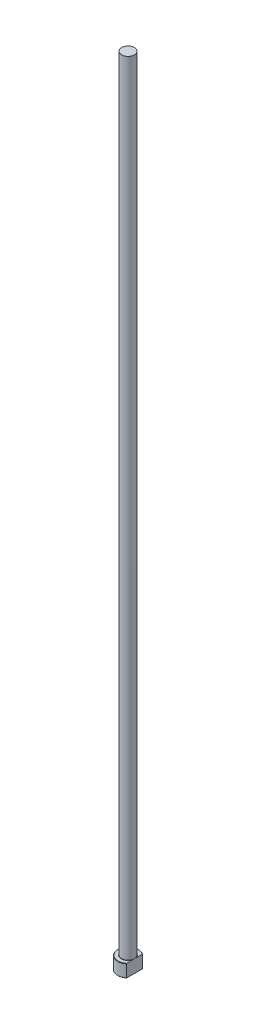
ISO-10303-21;
HEADER;
FILE_DESCRIPTION(('STEP AP214'),'2;1');
FILE_NAME('part.step','',(''),(''),'','','');
FILE_SCHEMA(('AUTOMOTIVE_DESIGN { 1 0 10303 214 1 1 1 1 }'));
ENDSEC;
DATA;
#1=APPLICATION_CONTEXT('core data for automotive mechanical design processes');
#2=APPLICATION_PROTOCOL_DEFINITION('international standard','automotive_design',2000,#1);
#3=PRODUCT_CONTEXT('',#1,'mechanical');
#4=PRODUCT('Part','Part','',(#3));
#5=PRODUCT_RELATED_PRODUCT_CATEGORY('part','',(#4));
#6=PRODUCT_DEFINITION_FORMATION('','',#4);
#7=PRODUCT_DEFINITION_CONTEXT('part definition',#1,'design');
#8=PRODUCT_DEFINITION('design','',#6,#7);
#9=PRODUCT_DEFINITION_SHAPE('','',#8);
#10=(LENGTH_UNIT() NAMED_UNIT(*) SI_UNIT(.MILLI.,.METRE.));
#11=(NAMED_UNIT(*) PLANE_ANGLE_UNIT() SI_UNIT($,.RADIAN.));
#12=(NAMED_UNIT(*) SI_UNIT($,.STERADIAN.) SOLID_ANGLE_UNIT());
#13=UNCERTAINTY_MEASURE_WITH_UNIT(LENGTH_MEASURE(1.E-05),#10,'distance_accuracy_value','');
#14=(GEOMETRIC_REPRESENTATION_CONTEXT(3) GLOBAL_UNCERTAINTY_ASSIGNED_CONTEXT((#13)) GLOBAL_UNIT_ASSIGNED_CONTEXT((#10,
#11,#12)) REPRESENTATION_CONTEXT('',''));
#15=CARTESIAN_POINT('',(0.,0.,0.));
#16=DIRECTION('',(0.,0.,1.));
#17=DIRECTION('',(1.,0.,0.));
#18=AXIS2_PLACEMENT_3D('',#15,#16,#17);
#19=CARTESIAN_POINT('',(0.,0.,0.));
#20=DIRECTION('',(0.,-1.,0.));
#21=DIRECTION('',(0.,0.,-1.));
#22=AXIS2_PLACEMENT_3D('',#19,#20,#21);
#23=PLANE('',#22);
#24=CARTESIAN_POINT('',(0.,0.,0.));
#25=DIRECTION('',(0.,-1.,0.));
#26=DIRECTION('',(0.,0.,-1.));
#27=AXIS2_PLACEMENT_3D('',#24,#25,#26);
#28=CIRCLE('',#27,6.29999999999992);
#29=CARTESIAN_POINT('',(3.99999999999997,0.,4.8672374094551));
#30=VERTEX_POINT('',#29);
#31=CARTESIAN_POINT('',(3.99999999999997,0.,-4.8672374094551));
#32=VERTEX_POINT('',#31);
#33=EDGE_CURVE('E98',#30,#32,#28,.T.);
#34=ORIENTED_EDGE('',*,*,#33,.T.);
#35=DIRECTION('',(0.,0.,1.));
#36=VECTOR('',#35,1.);
#37=CARTESIAN_POINT('',(3.99999999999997,0.,5.12347538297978));
#38=LINE('',#37,#36);
#39=EDGE_CURVE('E83',#32,#30,#38,.T.);
#40=ORIENTED_EDGE('',*,*,#39,.T.);
#41=EDGE_LOOP('',(#34,#40));
#42=FACE_BOUND('',#41,.T.);
#43=ADVANCED_FACE('F32',(#42),#23,.T.);
#44=CARTESIAN_POINT('',(0.,259.958771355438,0.));
#45=DIRECTION('',(0.,1.,0.));
#46=DIRECTION('',(0.,0.,1.));
#47=AXIS2_PLACEMENT_3D('',#44,#45,#46);
#48=CYLINDRICAL_SURFACE('',#47,6.49999999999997);
#49=CARTESIAN_POINT('',(0.,7.80000000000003,0.));
#50=DIRECTION('',(0.,1.,0.));
#51=DIRECTION('',(0.,0.,1.));
#52=AXIS2_PLACEMENT_3D('',#49,#50,#51);
#53=CIRCLE('',#52,6.49999999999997);
#54=CARTESIAN_POINT('',(3.99999999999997,7.80000000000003,5.12347538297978));
#55=VERTEX_POINT('',#54);
#56=CARTESIAN_POINT('',(3.99999999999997,7.80000000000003,-5.12347538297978));
#57=VERTEX_POINT('',#56);
#58=EDGE_CURVE('E104',#55,#57,#53,.F.);
#59=ORIENTED_EDGE('',*,*,#58,.T.);
#60=DIRECTION('',(0.,-1.,0.));
#61=VECTOR('',#60,1.);
#62=CARTESIAN_POINT('',(3.99999999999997,500.,-5.12347538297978));
#63=LINE('',#62,#61);
#64=CARTESIAN_POINT('',(3.99999999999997,0.200000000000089,-5.12347538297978));
#65=VERTEX_POINT('',#64);
#66=EDGE_CURVE('E183',#57,#65,#63,.T.);
#67=ORIENTED_EDGE('',*,*,#66,.T.);
#68=CARTESIAN_POINT('',(0.,0.200000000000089,0.));
#69=DIRECTION('',(0.,-1.,0.));
#70=DIRECTION('',(0.,0.,-1.));
#71=AXIS2_PLACEMENT_3D('',#68,#69,#70);
#72=CIRCLE('',#71,6.49999999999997);
#73=CARTESIAN_POINT('',(3.99999999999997,0.200000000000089,5.12347538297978));
#74=VERTEX_POINT('',#73);
#75=EDGE_CURVE('E100',#65,#74,#72,.F.);
#76=ORIENTED_EDGE('',*,*,#75,.T.);
#77=DIRECTION('',(0.,-1.,0.));
#78=VECTOR('',#77,1.);
#79=CARTESIAN_POINT('',(3.99999999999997,500.,5.12347538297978));
#80=LINE('',#79,#78);
#81=EDGE_CURVE('E93',#55,#74,#80,.T.);
#82=ORIENTED_EDGE('',*,*,#81,.F.);
#83=EDGE_LOOP('',(#59,#67,#76,#82));
#84=FACE_BOUND('',#83,.T.);
#85=ADVANCED_FACE('F158',(#84),#48,.T.);
#86=CARTESIAN_POINT('',(-6.49999999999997,8.,0.));
#87=DIRECTION('',(0.,1.,0.));
#88=DIRECTION('',(0.,0.,1.));
#89=AXIS2_PLACEMENT_3D('',#86,#87,#88);
#90=PLANE('',#89);
#91=CARTESIAN_POINT('',(0.,8.,0.));
#92=DIRECTION('',(0.,1.,0.));
#93=DIRECTION('',(0.,0.,1.));
#94=AXIS2_PLACEMENT_3D('',#91,#92,#93);
#95=CIRCLE('',#94,6.30000000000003);
#96=CARTESIAN_POINT('',(3.99999999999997,8.,-4.86723740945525));
#97=VERTEX_POINT('',#96);
#98=CARTESIAN_POINT('',(3.99999999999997,8.,4.86723740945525));
#99=VERTEX_POINT('',#98);
#100=EDGE_CURVE('E178',#97,#99,#95,.T.);
#101=ORIENTED_EDGE('',*,*,#100,.T.);
#102=DIRECTION('',(0.,0.,-1.));
#103=VECTOR('',#102,1.);
#104=CARTESIAN_POINT('',(3.99999999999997,8.,0.));
#105=LINE('',#104,#103);
#106=CARTESIAN_POINT('',(3.99999999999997,7.99999999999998,1.28062484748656));
#107=VERTEX_POINT('',#106);
#108=EDGE_CURVE('E57',#99,#107,#105,.T.);
#109=ORIENTED_EDGE('',*,*,#108,.T.);
#110=CARTESIAN_POINT('',(0.,8.,0.));
#111=DIRECTION('',(0.,1.,0.));
#112=DIRECTION('',(0.,0.,1.));
#113=AXIS2_PLACEMENT_3D('',#110,#111,#112);
#114=CIRCLE('',#113,4.19999999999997);
#115=CARTESIAN_POINT('',(3.99999999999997,7.99999999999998,-1.28062484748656));
#116=VERTEX_POINT('',#115);
#117=EDGE_CURVE('E107',#107,#116,#114,.F.);
#118=ORIENTED_EDGE('',*,*,#117,.T.);
#119=EDGE_CURVE('E136',#116,#97,#105,.T.);
#120=ORIENTED_EDGE('',*,*,#119,.T.);
#121=EDGE_LOOP('',(#101,#109,#118,#120));
#122=FACE_BOUND('',#121,.T.);
#123=ADVANCED_FACE('F147',(#122),#90,.T.);
#124=CARTESIAN_POINT('',(0.,8.00000000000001,0.));
#125=DIRECTION('',(0.,-1.,0.));
#126=DIRECTION('',(0.,0.,-1.));
#127=AXIS2_PLACEMENT_3D('',#124,#125,#126);
#128=CONICAL_SURFACE('',#127,6.30000000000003,0.785398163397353);
#129=ORIENTED_EDGE('',*,*,#58,.F.);
#130=CARTESIAN_POINT('',(3.99999999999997,2.33835680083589,11.2730168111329));
#131=CARTESIAN_POINT('',(3.99999999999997,2.50751109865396,11.0935258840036));
#132=CARTESIAN_POINT('',(3.99999999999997,2.6764300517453,10.9138129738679));
#133=CARTESIAN_POINT('',(3.99999999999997,3.0137169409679,10.5538688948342));
#134=CARTESIAN_POINT('',(3.99999999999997,3.18208487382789,10.3736377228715));
#135=CARTESIAN_POINT('',(3.99999999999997,3.68651578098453,9.8317608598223));
#136=CARTESIAN_POINT('',(3.99999999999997,4.02162663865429,9.46922758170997));
#137=CARTESIAN_POINT('',(3.99999999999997,4.69839264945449,8.73004878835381));
#138=CARTESIAN_POINT('',(3.99999999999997,5.03994227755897,8.35330632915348));
#139=CARTESIAN_POINT('',(3.99999999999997,5.54813444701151,7.78474717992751));
#140=CARTESIAN_POINT('',(3.99999999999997,5.71678224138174,7.59472329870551));
#141=CARTESIAN_POINT('',(3.99999999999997,6.05243048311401,7.21322727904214));
#142=CARTESIAN_POINT('',(3.99999999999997,6.21943094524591,7.02175515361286));
#143=CARTESIAN_POINT('',(3.99999999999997,6.55125779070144,6.63720143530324));
#144=CARTESIAN_POINT('',(3.99999999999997,6.71608581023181,6.44412125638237));
#145=CARTESIAN_POINT('',(3.99999999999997,7.04317390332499,6.05578163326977));
#146=CARTESIAN_POINT('',(3.99999999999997,7.20543388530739,5.86052211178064));
#147=CARTESIAN_POINT('',(3.99999999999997,7.52702721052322,5.4668180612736));
#148=CARTESIAN_POINT('',(3.99999999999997,7.68635259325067,5.26836701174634));
#149=CARTESIAN_POINT('',(3.99999999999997,8.00060742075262,4.86803282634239));
#150=CARTESIAN_POINT('',(3.99999999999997,8.15553731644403,4.66615004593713));
#151=CARTESIAN_POINT('',(3.99999999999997,8.45751575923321,4.26060182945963));
#152=CARTESIAN_POINT('',(3.99999999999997,8.60464039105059,4.05699334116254));
#153=CARTESIAN_POINT('',(3.99999999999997,8.8909995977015,3.64409822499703));
#154=CARTESIAN_POINT('',(3.99999999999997,9.0302302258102,3.43480883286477));
#155=CARTESIAN_POINT('',(3.99999999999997,9.29677357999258,3.00991388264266));
#156=CARTESIAN_POINT('',(3.99999999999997,9.42413322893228,2.7943380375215));
#157=CARTESIAN_POINT('',(3.99999999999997,9.66227069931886,2.35430355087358));
#158=CARTESIAN_POINT('',(3.99999999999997,9.77306978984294,2.12985677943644));
#159=CARTESIAN_POINT('',(3.99999999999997,9.9232417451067,1.77981866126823));
#160=CARTESIAN_POINT('',(3.99999999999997,9.97150219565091,1.65804958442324));
#161=CARTESIAN_POINT('',(3.99999999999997,10.0598239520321,1.41150602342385));
#162=CARTESIAN_POINT('',(3.99999999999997,10.0998835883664,1.2867309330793));
#163=CARTESIAN_POINT('',(3.99999999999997,10.1699893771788,1.03512545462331));
#164=CARTESIAN_POINT('',(3.99999999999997,10.2000910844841,0.908310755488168));
#165=CARTESIAN_POINT('',(3.99999999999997,10.2490705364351,0.652511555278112));
#166=CARTESIAN_POINT('',(3.99999999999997,10.2679495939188,0.523527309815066));
#167=CARTESIAN_POINT('',(3.99999999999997,10.2934980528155,0.262809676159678));
#168=CARTESIAN_POINT('',(3.99999999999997,10.3000223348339,0.131061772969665));
#169=CARTESIAN_POINT('',(3.99999999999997,10.2999775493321,-0.132423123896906));
#170=CARTESIAN_POINT('',(3.99999999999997,10.2934092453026,-0.264160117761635));
#171=CARTESIAN_POINT('',(3.99999999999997,10.2675780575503,-0.526867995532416));
#172=CARTESIAN_POINT('',(3.99999999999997,10.2482669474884,-0.65783405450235));
#173=CARTESIAN_POINT('',(3.99999999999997,10.1980980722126,-0.917527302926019));
#174=CARTESIAN_POINT('',(3.99999999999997,10.1672371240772,-1.04625386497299));
#175=CARTESIAN_POINT('',(3.99999999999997,10.0805844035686,-1.35405733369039));
#176=CARTESIAN_POINT('',(3.99999999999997,10.0197633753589,-1.53171039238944));
#177=CARTESIAN_POINT('',(3.99999999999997,9.88274788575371,-1.88095872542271));
#178=CARTESIAN_POINT('',(3.99999999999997,9.80654370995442,-2.05255009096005));
#179=CARTESIAN_POINT('',(3.99999999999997,9.68319777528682,-2.30659899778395));
#180=CARTESIAN_POINT('',(3.99999999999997,9.64031955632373,-2.39117275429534));
#181=CARTESIAN_POINT('',(3.99999999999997,9.55202002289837,-2.55898629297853));
#182=CARTESIAN_POINT('',(3.99999999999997,9.50659867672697,-2.64222605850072));
#183=CARTESIAN_POINT('',(3.99999999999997,9.4135865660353,-2.80743574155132));
#184=CARTESIAN_POINT('',(3.99999999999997,9.3659966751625,-2.88940615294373));
#185=CARTESIAN_POINT('',(3.99999999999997,9.26892422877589,-3.05220990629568));
#186=CARTESIAN_POINT('',(3.99999999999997,9.21944176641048,-3.13304330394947));
#187=CARTESIAN_POINT('',(3.99999999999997,9.04529267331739,-3.41112924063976));
#188=CARTESIAN_POINT('',(3.99999999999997,8.91648308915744,-3.60579191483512));
#189=CARTESIAN_POINT('',(3.99999999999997,8.65175618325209,-3.99024288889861));
#190=CARTESIAN_POINT('',(3.99999999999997,8.51583685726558,-4.18002979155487));
#191=CARTESIAN_POINT('',(3.99999999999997,8.23863283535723,-4.55590680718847));
#192=CARTESIAN_POINT('',(3.99999999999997,8.09734319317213,-4.74199325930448));
#193=CARTESIAN_POINT('',(3.99999999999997,7.81082146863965,-5.11106130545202));
#194=CARTESIAN_POINT('',(3.99999999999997,7.66558980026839,-5.29404322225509));
#195=CARTESIAN_POINT('',(3.99999999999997,7.37148704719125,-5.65825720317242));
#196=CARTESIAN_POINT('',(3.99999999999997,7.22260377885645,-5.8394794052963));
#197=CARTESIAN_POINT('',(3.99999999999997,6.92240731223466,-6.19990198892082));
#198=CARTESIAN_POINT('',(3.99999999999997,6.77109406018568,-6.37910232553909));
#199=CARTESIAN_POINT('',(3.99999999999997,6.314431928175,-6.91404380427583));
#200=CARTESIAN_POINT('',(3.99999999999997,6.00619978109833,-7.26732233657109));
#201=CARTESIAN_POINT('',(3.99999999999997,5.4201977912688,-7.92915827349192));
#202=CARTESIAN_POINT('',(3.99999999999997,5.14297898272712,-8.23820650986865));
#203=CARTESIAN_POINT('',(3.99999999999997,4.58554936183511,-8.85367584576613));
#204=CARTESIAN_POINT('',(3.99999999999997,4.30533810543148,-9.16009654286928));
#205=CARTESIAN_POINT('',(3.99999999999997,3.74491435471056,-9.76850943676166));
#206=CARTESIAN_POINT('',(3.99999999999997,3.46471907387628,-10.0705175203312));
#207=CARTESIAN_POINT('',(3.99999999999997,2.90267484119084,-10.6728856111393));
#208=CARTESIAN_POINT('',(3.99999999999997,2.62082621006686,-10.9732459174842));
#209=CARTESIAN_POINT('',(3.99999999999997,2.3383568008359,-11.2730168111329));
#210=B_SPLINE_CURVE_WITH_KNOTS('',3,(#130,#131,#132,#133,#134,#135,#136,#137,#138,#139,#140,
#141,#142,#143,#144,#145,#146,#147,#148,#149,#150,#151,#152,#153,#154,#155,#156,#157,#158,#159,
#160,#161,#162,#163,#164,#165,#166,#167,#168,#169,#170,#171,#172,#173,#174,#175,#176,#177,#178,
#179,#180,#181,#182,#183,#184,#185,#186,#187,#188,#189,#190,#191,#192,#193,#194,#195,#196,#197,
#198,#199,#200,#201,#202,#203,#204,#205,#206,#207,#208,#209),.UNSPECIFIED.,.F.,.F.,(4,2,2,2,2,2,
2,2,2,2,2,2,2,2,2,2,2,2,2,2,2,2,2,2,2,2,2,2,2,2,2,2,2,2,2,2,2,2,2,4),(0.,0.739913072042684,
1.47983052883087,2.96088564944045,4.48640016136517,5.24860048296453,6.0107939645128,
6.77237616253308,7.53398545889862,8.29742301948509,9.06078197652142,9.81425476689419,
10.5681010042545,11.3188284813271,12.0685833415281,12.4613034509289,12.8541034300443,
13.2446735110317,13.6351978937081,14.0302815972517,14.4253422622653,14.8219067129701,
15.2185805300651,15.7809161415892,16.3436079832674,16.6280404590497,16.9124764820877,
17.196798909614,17.4811073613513,18.1811169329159,18.8813249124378,19.5821942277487,
20.2829902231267,20.98657518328,21.6901757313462,23.0966141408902,24.3420866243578,
25.5877465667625,26.823646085,28.0593133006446),.UNSPECIFIED.);
#211=EDGE_CURVE('E135',#55,#99,#210,.T.);
#212=ORIENTED_EDGE('',*,*,#211,.T.);
#213=ORIENTED_EDGE('',*,*,#100,.F.);
#214=EDGE_CURVE('E127',#97,#57,#210,.T.);
#215=ORIENTED_EDGE('',*,*,#214,.T.);
#216=EDGE_LOOP('',(#129,#212,#213,#215));
#217=FACE_BOUND('',#216,.T.);
#218=ADVANCED_FACE('F143',(#217),#128,.T.);
#219=CARTESIAN_POINT('',(0.,0.200000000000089,0.));
#220=DIRECTION('',(0.,1.,0.));
#221=DIRECTION('',(0.,0.,1.));
#222=AXIS2_PLACEMENT_3D('',#219,#220,#221);
#223=CONICAL_SURFACE('',#222,6.49999999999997,0.785398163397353);
#224=ORIENTED_EDGE('',*,*,#75,.F.);
#225=CARTESIAN_POINT('',(3.99999999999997,5.66164319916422,-11.2730168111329));
#226=CARTESIAN_POINT('',(3.99999999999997,5.49248890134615,-11.0935258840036));
#227=CARTESIAN_POINT('',(3.99999999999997,5.32356994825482,-10.9138129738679));
#228=CARTESIAN_POINT('',(3.99999999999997,4.98628305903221,-10.5538688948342));
#229=CARTESIAN_POINT('',(3.99999999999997,4.81791512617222,-10.3736377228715));
#230=CARTESIAN_POINT('',(3.99999999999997,4.31348421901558,-9.8317608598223));
#231=CARTESIAN_POINT('',(3.99999999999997,3.97837336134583,-9.46922758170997));
#232=CARTESIAN_POINT('',(3.99999999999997,3.30160735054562,-8.73004878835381));
#233=CARTESIAN_POINT('',(3.99999999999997,2.96005772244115,-8.35330632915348));
#234=CARTESIAN_POINT('',(3.99999999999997,2.45186555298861,-7.78474717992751));
#235=CARTESIAN_POINT('',(3.99999999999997,2.28321775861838,-7.59472329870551));
#236=CARTESIAN_POINT('',(3.99999999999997,1.9475695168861,-7.21322727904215));
#237=CARTESIAN_POINT('',(3.99999999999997,1.78056905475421,-7.02175515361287));
#238=CARTESIAN_POINT('',(3.99999999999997,1.44874220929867,-6.63720143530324));
#239=CARTESIAN_POINT('',(3.99999999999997,1.28391418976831,-6.44412125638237));
#240=CARTESIAN_POINT('',(3.99999999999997,0.95682609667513,-6.05578163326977));
#241=CARTESIAN_POINT('',(3.99999999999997,0.794566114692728,-5.86052211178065));
#242=CARTESIAN_POINT('',(3.99999999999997,0.472972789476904,-5.4668180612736));
#243=CARTESIAN_POINT('',(3.99999999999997,0.313647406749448,-5.26836701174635));
#244=CARTESIAN_POINT('',(3.99999999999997,-0.000607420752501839,-4.86803282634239));
#245=CARTESIAN_POINT('',(3.99999999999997,-0.155537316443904,-4.66615004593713));
#246=CARTESIAN_POINT('',(3.99999999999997,-0.457515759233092,-4.26060182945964));
#247=CARTESIAN_POINT('',(3.99999999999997,-0.604640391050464,-4.05699334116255));
#248=CARTESIAN_POINT('',(3.99999999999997,-0.890999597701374,-3.64409822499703));
#249=CARTESIAN_POINT('',(3.99999999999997,-1.03023022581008,-3.43480883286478));
#250=CARTESIAN_POINT('',(3.99999999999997,-1.29677357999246,-3.00991388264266));
#251=CARTESIAN_POINT('',(3.99999999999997,-1.42413322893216,-2.79433803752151));
#252=CARTESIAN_POINT('',(3.99999999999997,-1.66227069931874,-2.35430355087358));
#253=CARTESIAN_POINT('',(3.99999999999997,-1.77306978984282,-2.12985677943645));
#254=CARTESIAN_POINT('',(3.99999999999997,-1.92324174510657,-1.77981866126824));
#255=CARTESIAN_POINT('',(3.99999999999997,-1.97150219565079,-1.65804958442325));
#256=CARTESIAN_POINT('',(3.99999999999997,-2.05982395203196,-1.41150602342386));
#257=CARTESIAN_POINT('',(3.99999999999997,-2.09988358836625,-1.28673093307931));
#258=CARTESIAN_POINT('',(3.99999999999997,-2.1699893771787,-1.03512545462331));
#259=CARTESIAN_POINT('',(3.99999999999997,-2.20009108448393,-0.908310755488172));
#260=CARTESIAN_POINT('',(3.99999999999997,-2.249070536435,-0.652511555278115));
#261=CARTESIAN_POINT('',(3.99999999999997,-2.26794959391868,-0.52352730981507));
#262=CARTESIAN_POINT('',(3.99999999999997,-2.29349805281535,-0.262809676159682));
#263=CARTESIAN_POINT('',(3.99999999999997,-2.30002233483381,-0.131061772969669));
#264=CARTESIAN_POINT('',(3.99999999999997,-2.29997754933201,0.132423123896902));
#265=CARTESIAN_POINT('',(3.99999999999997,-2.29340924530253,0.264160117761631));
#266=CARTESIAN_POINT('',(3.99999999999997,-2.26757805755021,0.526867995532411));
#267=CARTESIAN_POINT('',(3.99999999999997,-2.24826694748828,0.657834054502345));
#268=CARTESIAN_POINT('',(3.99999999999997,-2.19809807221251,0.917527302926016));
#269=CARTESIAN_POINT('',(3.99999999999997,-2.16723712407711,1.04625386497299));
#270=CARTESIAN_POINT('',(3.99999999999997,-2.08058440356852,1.35405733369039));
#271=CARTESIAN_POINT('',(3.99999999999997,-2.01976337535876,1.53171039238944));
#272=CARTESIAN_POINT('',(3.99999999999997,-1.88274788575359,1.88095872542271));
#273=CARTESIAN_POINT('',(3.99999999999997,-1.8065437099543,2.05255009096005));
#274=CARTESIAN_POINT('',(3.99999999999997,-1.6831977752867,2.30659899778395));
#275=CARTESIAN_POINT('',(3.99999999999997,-1.64031955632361,2.39117275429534));
#276=CARTESIAN_POINT('',(3.99999999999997,-1.55202002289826,2.55898629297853));
#277=CARTESIAN_POINT('',(3.99999999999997,-1.50659867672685,2.64222605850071));
#278=CARTESIAN_POINT('',(3.99999999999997,-1.41358656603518,2.80743574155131));
#279=CARTESIAN_POINT('',(3.99999999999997,-1.36599667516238,2.88940615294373));
#280=CARTESIAN_POINT('',(3.99999999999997,-1.26892422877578,3.05220990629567));
#281=CARTESIAN_POINT('',(3.99999999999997,-1.21944176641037,3.13304330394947));
#282=CARTESIAN_POINT('',(3.99999999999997,-1.04529267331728,3.41112924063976));
#283=CARTESIAN_POINT('',(3.99999999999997,-0.916483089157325,3.60579191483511));
#284=CARTESIAN_POINT('',(3.99999999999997,-0.651756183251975,3.99024288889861));
#285=CARTESIAN_POINT('',(3.99999999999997,-0.515836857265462,4.18002979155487));
#286=CARTESIAN_POINT('',(3.99999999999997,-0.23863283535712,4.55590680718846));
#287=CARTESIAN_POINT('',(3.99999999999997,-0.0973431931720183,4.74199325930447));
#288=CARTESIAN_POINT('',(3.99999999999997,0.189178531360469,5.11106130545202));
#289=CARTESIAN_POINT('',(3.99999999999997,0.334410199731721,5.29404322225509));
#290=CARTESIAN_POINT('',(3.99999999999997,0.628512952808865,5.65825720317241));
#291=CARTESIAN_POINT('',(3.99999999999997,0.777396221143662,5.8394794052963));
#292=CARTESIAN_POINT('',(3.99999999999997,1.07759268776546,6.19990198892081));
#293=CARTESIAN_POINT('',(3.99999999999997,1.22890593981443,6.37910232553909));
#294=CARTESIAN_POINT('',(3.99999999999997,1.68556807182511,6.91404380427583));
#295=CARTESIAN_POINT('',(3.99999999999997,1.99380021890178,7.26732233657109));
#296=CARTESIAN_POINT('',(3.99999999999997,2.57980220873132,7.92915827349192));
#297=CARTESIAN_POINT('',(3.99999999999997,2.857021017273,8.23820650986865));
#298=CARTESIAN_POINT('',(3.99999999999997,3.41445063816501,8.85367584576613));
#299=CARTESIAN_POINT('',(3.99999999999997,3.69466189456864,9.16009654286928));
#300=CARTESIAN_POINT('',(3.99999999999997,4.25508564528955,9.76850943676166));
#301=CARTESIAN_POINT('',(3.99999999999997,4.53528092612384,10.0705175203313));
#302=CARTESIAN_POINT('',(3.99999999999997,5.09732515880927,10.6728856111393));
#303=CARTESIAN_POINT('',(3.99999999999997,5.37917378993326,10.9732459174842));
#304=CARTESIAN_POINT('',(3.99999999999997,5.66164319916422,11.2730168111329));
#305=B_SPLINE_CURVE_WITH_KNOTS('',3,(#225,#226,#227,#228,#229,#230,#231,#232,#233,#234,#235,
#236,#237,#238,#239,#240,#241,#242,#243,#244,#245,#246,#247,#248,#249,#250,#251,#252,#253,#254,
#255,#256,#257,#258,#259,#260,#261,#262,#263,#264,#265,#266,#267,#268,#269,#270,#271,#272,#273,
#274,#275,#276,#277,#278,#279,#280,#281,#282,#283,#284,#285,#286,#287,#288,#289,#290,#291,#292,
#293,#294,#295,#296,#297,#298,#299,#300,#301,#302,#303,#304),.UNSPECIFIED.,.F.,.F.,(4,2,2,2,2,2,
2,2,2,2,2,2,2,2,2,2,2,2,2,2,2,2,2,2,2,2,2,2,2,2,2,2,2,2,2,2,2,2,2,4),(0.,0.739913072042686,
1.47983052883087,2.96088564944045,4.48640016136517,5.24860048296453,6.0107939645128,
6.77237616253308,7.53398545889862,8.29742301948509,9.06078197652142,9.81425476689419,
10.5681010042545,11.3188284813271,12.0685833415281,12.4613034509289,12.8541034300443,
13.2446735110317,13.6351978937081,14.0302815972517,14.4253422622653,14.82190671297,
15.2185805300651,15.7809161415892,16.3436079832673,16.6280404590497,16.9124764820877,
17.196798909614,17.4811073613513,18.1811169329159,18.8813249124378,19.5821942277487,
20.2829902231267,20.98657518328,21.6901757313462,23.0966141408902,24.3420866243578,
25.5877465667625,26.823646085,28.0593133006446),.UNSPECIFIED.);
#306=EDGE_CURVE('E86',#65,#32,#305,.T.);
#307=ORIENTED_EDGE('',*,*,#306,.T.);
#308=ORIENTED_EDGE('',*,*,#33,.F.);
#309=EDGE_CURVE('E89',#30,#74,#305,.T.);
#310=ORIENTED_EDGE('',*,*,#309,.T.);
#311=EDGE_LOOP('',(#224,#307,#308,#310));
#312=FACE_BOUND('',#311,.T.);
#313=ADVANCED_FACE('F97',(#312),#223,.T.);
#314=CARTESIAN_POINT('',(0.,8.19999999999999,0.));
#315=DIRECTION('',(0.,1.,0.));
#316=DIRECTION('',(0.,0.,1.));
#317=AXIS2_PLACEMENT_3D('',#314,#315,#316);
#318=TOROIDAL_SURFACE('',#317,4.19999999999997,0.2);
#319=CARTESIAN_POINT('',(3.99999999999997,8.19999999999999,0.));
#320=CARTESIAN_POINT('',(3.99999999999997,8.20000051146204,6.54993054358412E-12));
#321=CARTESIAN_POINT('',(3.99999999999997,8.20000102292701,-2.33849533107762E-07));
#322=CARTESIAN_POINT('',(3.99999999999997,8.20000197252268,-8.59106931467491E-07));
#323=CARTESIAN_POINT('',(3.99999999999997,8.20000239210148,-1.26721109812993E-06));
#324=CARTESIAN_POINT('',(3.99999999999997,8.20000328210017,-2.25074280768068E-06));
#325=CARTESIAN_POINT('',(3.99999999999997,8.20000373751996,-2.84212519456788E-06));
#326=CARTESIAN_POINT('',(3.99999999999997,8.20000453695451,-4.05328052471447E-06));
#327=CARTESIAN_POINT('',(3.99999999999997,8.20000488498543,-4.67066382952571E-06));
#328=CARTESIAN_POINT('',(3.99999999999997,8.20000621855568,-7.11716611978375E-06));
#329=CARTESIAN_POINT('',(3.99999999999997,8.20000713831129,-8.98558487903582E-06));
#330=CARTESIAN_POINT('',(3.99999999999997,8.20000861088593,-1.26418243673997E-05));
#331=CARTESIAN_POINT('',(3.99999999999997,8.2000091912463,-1.44189480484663E-05));
#332=CARTESIAN_POINT('',(3.99999999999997,8.20001169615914,-2.20915838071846E-05));
#333=CARTESIAN_POINT('',(3.99999999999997,8.20001361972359,-2.79894750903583E-05));
#334=CARTESIAN_POINT('',(3.99999999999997,8.20001638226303,-3.90228536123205E-05));
#335=CARTESIAN_POINT('',(3.99999999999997,8.20001734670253,-4.41264580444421E-05));
#336=CARTESIAN_POINT('',(3.99999999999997,8.20002447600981,-8.24800902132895E-05));
#337=CARTESIAN_POINT('',(3.99999999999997,8.20003000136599,-0.000115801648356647));
#338=CARTESIAN_POINT('',(3.99999999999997,8.2000541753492,-0.000248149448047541));
#339=CARTESIAN_POINT('',(3.99999999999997,8.200077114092,-0.000346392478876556));
#340=CARTESIAN_POINT('',(3.99999999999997,8.20016695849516,-0.000737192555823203));
#341=CARTESIAN_POINT('',(3.99999999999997,8.20023118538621,-0.00103015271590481));
#342=CARTESIAN_POINT('',(3.99999999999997,8.20048943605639,-0.00220000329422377));
#343=CARTESIAN_POINT('',(3.99999999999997,8.20068689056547,-0.00307635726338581));
#344=CARTESIAN_POINT('',(3.99999999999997,8.20151245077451,-0.00674945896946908));
#345=CARTESIAN_POINT('',(3.99999999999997,8.20213623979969,-0.00954688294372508));
#346=CARTESIAN_POINT('',(3.99999999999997,8.21069858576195,-0.0479346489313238));
#347=CARTESIAN_POINT('',(3.99999999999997,8.21866411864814,-0.0835210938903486));
#348=CARTESIAN_POINT('',(3.99999999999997,8.23536251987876,-0.158673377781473));
#349=CARTESIAN_POINT('',(3.99999999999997,8.24408230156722,-0.198242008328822));
#350=CARTESIAN_POINT('',(3.99999999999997,8.25875222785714,-0.265746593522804));
#351=CARTESIAN_POINT('',(3.99999999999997,8.26476038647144,-0.293669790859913));
#352=CARTESIAN_POINT('',(3.99999999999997,8.27645424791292,-0.348796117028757));
#353=CARTESIAN_POINT('',(3.99999999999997,8.28214427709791,-0.375998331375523));
#354=CARTESIAN_POINT('',(3.99999999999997,8.30043795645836,-0.465036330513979));
#355=CARTESIAN_POINT('',(3.99999999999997,8.31263876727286,-0.526956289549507));
#356=CARTESIAN_POINT('',(3.99999999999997,8.33561275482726,-0.65168218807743));
#357=CARTESIAN_POINT('',(3.99999999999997,8.34637105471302,-0.714490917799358));
#358=CARTESIAN_POINT('',(3.99999999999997,8.36658245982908,-0.846543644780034));
#359=CARTESIAN_POINT('',(3.99999999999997,8.37580902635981,-0.915823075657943));
#360=CARTESIAN_POINT('',(3.99999999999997,8.39039845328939,-1.05460878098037));
#361=CARTESIAN_POINT('',(3.99999999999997,8.39577328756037,-1.1241136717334));
#362=CARTESIAN_POINT('',(3.99999999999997,8.39959291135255,-1.22750409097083));
#363=CARTESIAN_POINT('',(3.99999999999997,8.40018074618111,-1.26130913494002));
#364=CARTESIAN_POINT('',(3.99999999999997,8.39972074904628,-1.32890426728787));
#365=CARTESIAN_POINT('',(3.99999999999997,8.39867346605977,-1.36269435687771));
#366=CARTESIAN_POINT('',(3.99999999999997,8.3945557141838,-1.42954089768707));
#367=CARTESIAN_POINT('',(3.99999999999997,8.39152235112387,-1.46259952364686));
#368=CARTESIAN_POINT('',(3.99999999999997,8.38286512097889,-1.52835908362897));
#369=CARTESIAN_POINT('',(3.99999999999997,8.37724516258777,-1.56106048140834));
#370=CARTESIAN_POINT('',(3.99999999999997,8.36402263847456,-1.61846409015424));
#371=CARTESIAN_POINT('',(3.99999999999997,8.3571375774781,-1.64332989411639));
#372=CARTESIAN_POINT('',(3.99999999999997,8.3402719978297,-1.69212725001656));
#373=CARTESIAN_POINT('',(3.99999999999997,8.33028876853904,-1.71605796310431));
#374=CARTESIAN_POINT('',(3.99999999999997,8.31168601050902,-1.75008824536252));
#375=CARTESIAN_POINT('',(3.99999999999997,8.30485398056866,-1.76115159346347));
#376=CARTESIAN_POINT('',(3.99999999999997,8.28960114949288,-1.78210611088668));
#377=CARTESIAN_POINT('',(3.99999999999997,8.28118962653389,-1.79200360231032));
#378=CARTESIAN_POINT('',(3.99999999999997,8.26737388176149,-1.80493475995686));
#379=CARTESIAN_POINT('',(3.99999999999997,8.26276322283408,-1.80881084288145));
#380=CARTESIAN_POINT('',(3.99999999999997,8.25306023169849,-1.81592390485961));
#381=CARTESIAN_POINT('',(3.99999999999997,8.24796771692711,-1.81916064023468));
#382=CARTESIAN_POINT('',(3.99999999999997,8.237244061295,-1.8248051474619));
#383=CARTESIAN_POINT('',(3.99999999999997,8.23160666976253,-1.82720134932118));
#384=CARTESIAN_POINT('',(3.99999999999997,8.21997194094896,-1.8308361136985));
#385=CARTESIAN_POINT('',(3.99999999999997,8.21397550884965,-1.83207746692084));
#386=CARTESIAN_POINT('',(3.99999999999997,8.20263132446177,-1.83315692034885));
#387=CARTESIAN_POINT('',(3.99999999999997,8.19729868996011,-1.8331541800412));
#388=CARTESIAN_POINT('',(3.99999999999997,8.18672944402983,-1.83214057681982));
#389=CARTESIAN_POINT('',(3.99999999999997,8.18149289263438,-1.83112910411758));
#390=CARTESIAN_POINT('',(3.99999999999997,8.17078487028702,-1.82806907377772));
#391=CARTESIAN_POINT('',(3.99999999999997,8.16533999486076,-1.82592931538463));
#392=CARTESIAN_POINT('',(3.99999999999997,8.15487296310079,-1.82079411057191));
#393=CARTESIAN_POINT('',(3.99999999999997,8.14985146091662,-1.81779737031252));
#394=CARTESIAN_POINT('',(3.99999999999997,8.13773920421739,-1.80942140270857));
#395=CARTESIAN_POINT('',(3.99999999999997,8.13094534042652,-1.80361715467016));
#396=CARTESIAN_POINT('',(3.99999999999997,8.11830005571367,-1.79106454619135));
#397=CARTESIAN_POINT('',(3.99999999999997,8.11245134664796,-1.78431356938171));
#398=CARTESIAN_POINT('',(3.99999999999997,8.09656788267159,-1.76377799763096));
#399=CARTESIAN_POINT('',(3.99999999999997,8.08757958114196,-1.7491934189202));
#400=CARTESIAN_POINT('',(3.99999999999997,8.07165230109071,-1.71899459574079));
#401=CARTESIAN_POINT('',(3.99999999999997,8.06471615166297,-1.70337896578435));
#402=CARTESIAN_POINT('',(3.99999999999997,8.0496464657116,-1.66459665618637));
#403=CARTESIAN_POINT('',(3.99999999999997,8.04232016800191,-1.64111968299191));
#404=CARTESIAN_POINT('',(3.99999999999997,8.02986383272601,-1.59357415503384));
#405=CARTESIAN_POINT('',(3.99999999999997,8.02473853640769,-1.56950444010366));
#406=CARTESIAN_POINT('',(3.99999999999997,8.01610324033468,-1.52067485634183));
#407=CARTESIAN_POINT('',(3.99999999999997,8.01262117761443,-1.49591014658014));
#408=CARTESIAN_POINT('',(3.99999999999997,8.00704256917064,-1.44626562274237));
#409=CARTESIAN_POINT('',(3.99999999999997,8.00494421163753,-1.42138600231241));
#410=CARTESIAN_POINT('',(3.99999999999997,8.00075077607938,-1.35341124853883));
#411=CARTESIAN_POINT('',(3.99999999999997,7.99977133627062,-1.31024782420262));
#412=CARTESIAN_POINT('',(3.99999999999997,8.00031303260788,-1.22392963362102));
#413=CARTESIAN_POINT('',(3.99999999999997,8.00183577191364,-1.18077489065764));
#414=CARTESIAN_POINT('',(3.99999999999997,8.00931890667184,-1.05109835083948));
#415=CARTESIAN_POINT('',(3.99999999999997,8.01820648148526,-0.964749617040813));
#416=CARTESIAN_POINT('',(3.99999999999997,8.03989342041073,-0.80020089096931));
#417=CARTESIAN_POINT('',(3.99999999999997,8.05228816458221,-0.72194180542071));
#418=CARTESIAN_POINT('',(3.99999999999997,8.07962880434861,-0.566748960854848));
#419=CARTESIAN_POINT('',(3.99999999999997,8.09454562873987,-0.489810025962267));
#420=CARTESIAN_POINT('',(3.99999999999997,8.11594630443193,-0.385191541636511));
#421=CARTESIAN_POINT('',(3.99999999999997,8.12174621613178,-0.357366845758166));
#422=CARTESIAN_POINT('',(3.99999999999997,8.13367824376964,-0.300962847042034));
#423=CARTESIAN_POINT('',(3.99999999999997,8.13981511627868,-0.272384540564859));
#424=CARTESIAN_POINT('',(3.99999999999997,8.15483459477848,-0.203169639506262));
#425=CARTESIAN_POINT('',(3.99999999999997,8.16378036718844,-0.162546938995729));
#426=CARTESIAN_POINT('',(3.99999999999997,8.1809159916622,-0.085400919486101));
#427=CARTESIAN_POINT('',(3.99999999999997,8.18909179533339,-0.0488746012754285));
#428=CARTESIAN_POINT('',(3.99999999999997,8.1978638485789,-0.00954647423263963));
#429=CARTESIAN_POINT('',(3.99999999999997,8.1984877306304,-0.00674864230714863));
#430=CARTESIAN_POINT('',(3.99999999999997,8.19931331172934,-0.00307545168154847));
#431=CARTESIAN_POINT('',(3.99999999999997,8.19951069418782,-0.00219941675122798));
#432=CARTESIAN_POINT('',(3.99999999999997,8.19976885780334,-0.00102996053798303));
#433=CARTESIAN_POINT('',(3.99999999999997,8.1998330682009,-0.000737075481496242));
#434=CARTESIAN_POINT('',(3.99999999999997,8.19992289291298,-0.000346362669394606));
#435=CARTESIAN_POINT('',(3.99999999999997,8.19994582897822,-0.00024813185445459));
#436=CARTESIAN_POINT('',(3.99999999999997,8.19997000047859,-0.000115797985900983));
#437=CARTESIAN_POINT('',(3.99999999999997,8.19997552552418,-8.24780560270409E-05));
#438=CARTESIAN_POINT('',(3.99999999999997,8.19998265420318,-4.41260942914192E-05));
#439=CARTESIAN_POINT('',(3.99999999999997,8.19998361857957,-3.90225731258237E-05));
#440=CARTESIAN_POINT('',(3.99999999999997,8.1999863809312,-2.79893708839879E-05));
#441=CARTESIAN_POINT('',(3.99999999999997,8.19998830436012,-2.20915682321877E-05));
#442=CARTESIAN_POINT('',(3.99999999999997,8.19999080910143,-1.44190257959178E-05));
#443=CARTESIAN_POINT('',(3.99999999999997,8.19999138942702,-1.26419080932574E-05));
#444=CARTESIAN_POINT('',(3.99999999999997,8.19999286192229,-8.98567539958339E-06));
#445=CARTESIAN_POINT('',(3.99999999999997,8.19999378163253,-7.11725658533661E-06));
#446=CARTESIAN_POINT('',(3.99999999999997,8.19999511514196,-4.6707483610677E-06));
#447=CARTESIAN_POINT('',(3.99999999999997,8.19999546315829,-4.05336158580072E-06));
#448=CARTESIAN_POINT('',(3.99999999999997,8.19999626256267,-2.84219668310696E-06));
#449=CARTESIAN_POINT('',(3.99999999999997,8.19999671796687,-2.25080806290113E-06));
#450=CARTESIAN_POINT('',(3.99999999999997,8.19999760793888,-1.26726205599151E-06));
#451=CARTESIAN_POINT('',(3.99999999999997,8.1999980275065,-8.59150422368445E-07));
#452=CARTESIAN_POINT('',(3.99999999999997,8.1999989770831,-2.33873767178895E-07));
#453=CARTESIAN_POINT('',(3.99999999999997,8.19999948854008,-6.5499030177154E-12));
#454=CARTESIAN_POINT('',(3.99999999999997,8.19999999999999,0.));
#455=B_SPLINE_CURVE_WITH_KNOTS('',3,(#319,#320,#321,#322,#323,#324,#325,#326,#327,#328,#329,
#330,#331,#332,#333,#334,#335,#336,#337,#338,#339,#340,#341,#342,#343,#344,#345,#346,#347,#348,
#349,#350,#351,#352,#353,#354,#355,#356,#357,#358,#359,#360,#361,#362,#363,#364,#365,#366,#367,
#368,#369,#370,#371,#372,#373,#374,#375,#376,#377,#378,#379,#380,#381,#382,#383,#384,#385,#386,
#387,#388,#389,#390,#391,#392,#393,#394,#395,#396,#397,#398,#399,#400,#401,#402,#403,#404,#405,
#406,#407,#408,#409,#410,#411,#412,#413,#414,#415,#416,#417,#418,#419,#420,#421,#422,#423,#424,
#425,#426,#427,#428,#429,#430,#431,#432,#433,#434,#435,#436,#437,#438,#439,#440,#441,#442,#443,
#444,#445,#446,#447,#448,#449,#450,#451,#452,#453,#454),.UNSPECIFIED.,.T.,.F.,(4,2,2,2,2,2,2,2,
2,2,2,2,2,2,2,2,2,2,2,2,2,2,2,2,2,2,2,2,2,2,2,2,2,2,2,2,2,2,2,2,2,2,2,2,2,2,2,2,2,2,2,2,2,2,2,2,
2,2,2,2,2,2,2,2,2,2,2,4),(0.,1.56012555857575E-06,3.32588802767E-06,5.54921805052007E-06,
7.67484495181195E-06,1.39023129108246E-05,1.95054925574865E-05,3.80905014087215E-05,
5.36549268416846E-05,0.000155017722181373,0.000457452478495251,0.00135744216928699,
0.00405212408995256,0.01265083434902,0.122049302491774,0.243603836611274,0.329290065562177,
0.412662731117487,0.601981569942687,0.793123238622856,1.00273287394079,1.21168803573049,
1.31308928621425,1.41445649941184,1.51398193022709,1.61335745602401,1.69066291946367,
1.76803621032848,1.80696120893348,1.84566433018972,1.86369438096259,1.88173129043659,
1.90000754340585,1.91823951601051,1.93413978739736,1.95004967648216,1.96750510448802,
1.98498702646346,2.01164257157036,2.03837328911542,2.0894803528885,2.14065754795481,
2.21426121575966,2.28802264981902,2.36299656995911,2.43787212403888,2.56728534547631,
2.69678151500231,2.95692568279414,3.19457926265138,3.4296600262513,3.51492857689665,
3.60261719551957,3.72740578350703,3.83969348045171,3.84829344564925,3.85098714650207,
3.85188690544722,3.85218930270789,3.85229066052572,3.8523062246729,3.85232480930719,
3.85233041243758,3.85233663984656,3.85233876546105,3.85234098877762,3.85234275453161,
3.85234431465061),.UNSPECIFIED.);
#456=CARTESIAN_POINT('',(3.99999999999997,8.19999999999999,0.));
#457=VERTEX_POINT('',#456);
#458=EDGE_CURVE('E11',#116,#457,#455,.T.);
#459=ORIENTED_EDGE('',*,*,#458,.F.);
#460=ORIENTED_EDGE('',*,*,#117,.F.);
#461=CARTESIAN_POINT('',(3.99999999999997,8.19999999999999,0.));
#462=CARTESIAN_POINT('',(3.99999999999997,8.19999948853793,-6.54999323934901E-12));
#463=CARTESIAN_POINT('',(3.99999999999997,8.19999897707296,2.33849532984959E-07));
#464=CARTESIAN_POINT('',(3.99999999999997,8.19999802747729,8.59106931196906E-07));
#465=CARTESIAN_POINT('',(3.99999999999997,8.19999760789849,1.26721109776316E-06));
#466=CARTESIAN_POINT('',(3.99999999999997,8.1999967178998,2.25074280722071E-06));
#467=CARTESIAN_POINT('',(3.99999999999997,8.19999626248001,2.84212519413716E-06));
#468=CARTESIAN_POINT('',(3.99999999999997,8.19999546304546,4.05328052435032E-06));
#469=CARTESIAN_POINT('',(3.99999999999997,8.19999511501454,4.67066382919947E-06));
#470=CARTESIAN_POINT('',(3.99999999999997,8.19999378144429,7.11716611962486E-06));
#471=CARTESIAN_POINT('',(3.99999999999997,8.19999286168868,8.98558487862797E-06));
#472=CARTESIAN_POINT('',(3.99999999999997,8.19999138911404,1.26418243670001E-05));
#473=CARTESIAN_POINT('',(3.99999999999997,8.19999080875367,1.44189480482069E-05));
#474=CARTESIAN_POINT('',(3.99999999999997,8.19998830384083,2.20915838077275E-05));
#475=CARTESIAN_POINT('',(3.99999999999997,8.19998638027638,2.79894750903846E-05));
#476=CARTESIAN_POINT('',(3.99999999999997,8.19998361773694,3.90228536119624E-05));
#477=CARTESIAN_POINT('',(3.99999999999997,8.19998265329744,4.41264580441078E-05));
#478=CARTESIAN_POINT('',(3.99999999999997,8.19997552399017,8.24800902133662E-05));
#479=CARTESIAN_POINT('',(3.99999999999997,8.19996999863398,0.000115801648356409));
#480=CARTESIAN_POINT('',(3.99999999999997,8.19994582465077,0.000248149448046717));
#481=CARTESIAN_POINT('',(3.99999999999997,8.19992288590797,0.000346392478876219));
#482=CARTESIAN_POINT('',(3.99999999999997,8.19983304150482,0.000737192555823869));
#483=CARTESIAN_POINT('',(3.99999999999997,8.19976881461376,0.00103015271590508));
#484=CARTESIAN_POINT('',(3.99999999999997,8.19951056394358,0.00220000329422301));
#485=CARTESIAN_POINT('',(3.99999999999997,8.1993131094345,0.00307635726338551));
#486=CARTESIAN_POINT('',(3.99999999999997,8.19848754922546,0.00674945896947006));
#487=CARTESIAN_POINT('',(3.99999999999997,8.19786376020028,0.00954688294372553));
#488=CARTESIAN_POINT('',(3.99999999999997,8.18930141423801,0.047934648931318));
#489=CARTESIAN_POINT('',(3.99999999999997,8.18133588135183,0.083521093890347));
#490=CARTESIAN_POINT('',(3.99999999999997,8.16463748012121,0.158673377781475));
#491=CARTESIAN_POINT('',(3.99999999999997,8.15591769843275,0.198242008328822));
#492=CARTESIAN_POINT('',(3.99999999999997,8.14124777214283,0.265746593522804));
#493=CARTESIAN_POINT('',(3.99999999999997,8.13523961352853,0.293669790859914));
#494=CARTESIAN_POINT('',(3.99999999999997,8.12354575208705,0.348796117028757));
#495=CARTESIAN_POINT('',(3.99999999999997,8.11785572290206,0.375998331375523));
#496=CARTESIAN_POINT('',(3.99999999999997,8.09956204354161,0.465036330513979));
#497=CARTESIAN_POINT('',(3.99999999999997,8.08736123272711,0.526956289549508));
#498=CARTESIAN_POINT('',(3.99999999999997,8.06438724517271,0.65168218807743));
#499=CARTESIAN_POINT('',(3.99999999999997,8.05362894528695,0.714490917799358));
#500=CARTESIAN_POINT('',(3.99999999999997,8.03341754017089,0.846543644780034));
#501=CARTESIAN_POINT('',(3.99999999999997,8.02419097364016,0.915823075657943));
#502=CARTESIAN_POINT('',(3.99999999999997,8.00960154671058,1.05460878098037));
#503=CARTESIAN_POINT('',(3.99999999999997,8.0042267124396,1.1241136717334));
#504=CARTESIAN_POINT('',(3.99999999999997,8.00040708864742,1.22750409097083));
#505=CARTESIAN_POINT('',(3.99999999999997,7.99981925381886,1.26130913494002));
#506=CARTESIAN_POINT('',(3.99999999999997,8.00027925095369,1.32890426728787));
#507=CARTESIAN_POINT('',(3.99999999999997,8.0013265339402,1.36269435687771));
#508=CARTESIAN_POINT('',(3.99999999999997,8.00544428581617,1.42954089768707));
#509=CARTESIAN_POINT('',(3.99999999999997,8.0084776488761,1.46259952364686));
#510=CARTESIAN_POINT('',(3.99999999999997,8.01713487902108,1.52835908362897));
#511=CARTESIAN_POINT('',(3.99999999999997,8.0227548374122,1.56106048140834));
#512=CARTESIAN_POINT('',(3.99999999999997,8.03597736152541,1.61846409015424));
#513=CARTESIAN_POINT('',(3.99999999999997,8.04286242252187,1.64332989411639));
#514=CARTESIAN_POINT('',(3.99999999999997,8.05972800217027,1.69212725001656));
#515=CARTESIAN_POINT('',(3.99999999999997,8.06971123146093,1.71605796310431));
#516=CARTESIAN_POINT('',(3.99999999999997,8.08831398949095,1.75008824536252));
#517=CARTESIAN_POINT('',(3.99999999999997,8.09514601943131,1.76115159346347));
#518=CARTESIAN_POINT('',(3.99999999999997,8.11039885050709,1.78210611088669));
#519=CARTESIAN_POINT('',(3.99999999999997,8.11881037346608,1.79200360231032));
#520=CARTESIAN_POINT('',(3.99999999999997,8.13262611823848,1.80493475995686));
#521=CARTESIAN_POINT('',(3.99999999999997,8.13723677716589,1.80881084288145));
#522=CARTESIAN_POINT('',(3.99999999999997,8.14693976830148,1.81592390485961));
#523=CARTESIAN_POINT('',(3.99999999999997,8.15203228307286,1.81916064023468));
#524=CARTESIAN_POINT('',(3.99999999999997,8.16275593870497,1.8248051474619));
#525=CARTESIAN_POINT('',(3.99999999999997,8.16839333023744,1.82720134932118));
#526=CARTESIAN_POINT('',(3.99999999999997,8.18002805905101,1.8308361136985));
#527=CARTESIAN_POINT('',(3.99999999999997,8.18602449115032,1.83207746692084));
#528=CARTESIAN_POINT('',(3.99999999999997,8.1973686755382,1.83315692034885));
#529=CARTESIAN_POINT('',(3.99999999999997,8.20270131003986,1.8331541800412));
#530=CARTESIAN_POINT('',(3.99999999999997,8.21327055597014,1.83214057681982));
#531=CARTESIAN_POINT('',(3.99999999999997,8.21850710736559,1.83112910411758));
#532=CARTESIAN_POINT('',(3.99999999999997,8.22921512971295,1.82806907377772));
#533=CARTESIAN_POINT('',(3.99999999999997,8.23466000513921,1.82592931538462));
#534=CARTESIAN_POINT('',(3.99999999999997,8.24512703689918,1.82079411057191));
#535=CARTESIAN_POINT('',(3.99999999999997,8.25014853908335,1.81779737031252));
#536=CARTESIAN_POINT('',(3.99999999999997,8.26226079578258,1.80942140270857));
#537=CARTESIAN_POINT('',(3.99999999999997,8.26905465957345,1.80361715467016));
#538=CARTESIAN_POINT('',(3.99999999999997,8.2816999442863,1.79106454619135));
#539=CARTESIAN_POINT('',(3.99999999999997,8.28754865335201,1.78431356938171));
#540=CARTESIAN_POINT('',(3.99999999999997,8.30343211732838,1.76377799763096));
#541=CARTESIAN_POINT('',(3.99999999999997,8.31242041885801,1.7491934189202));
#542=CARTESIAN_POINT('',(3.99999999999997,8.32834769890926,1.71899459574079));
#543=CARTESIAN_POINT('',(3.99999999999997,8.335283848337,1.70337896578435));
#544=CARTESIAN_POINT('',(3.99999999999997,8.35035353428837,1.66459665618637));
#545=CARTESIAN_POINT('',(3.99999999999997,8.35767983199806,1.64111968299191));
#546=CARTESIAN_POINT('',(3.99999999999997,8.37013616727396,1.59357415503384));
#547=CARTESIAN_POINT('',(3.99999999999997,8.37526146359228,1.56950444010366));
#548=CARTESIAN_POINT('',(3.99999999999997,8.38389675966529,1.52067485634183));
#549=CARTESIAN_POINT('',(3.99999999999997,8.38737882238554,1.49591014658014));
#550=CARTESIAN_POINT('',(3.99999999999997,8.39295743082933,1.44626562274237));
#551=CARTESIAN_POINT('',(3.99999999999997,8.39505578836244,1.42138600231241));
#552=CARTESIAN_POINT('',(3.99999999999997,8.39924922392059,1.35341124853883));
#553=CARTESIAN_POINT('',(3.99999999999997,8.40022866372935,1.31024782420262));
#554=CARTESIAN_POINT('',(3.99999999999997,8.39968696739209,1.22392963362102));
#555=CARTESIAN_POINT('',(3.99999999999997,8.39816422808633,1.18077489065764));
#556=CARTESIAN_POINT('',(3.99999999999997,8.39068109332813,1.05109835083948));
#557=CARTESIAN_POINT('',(3.99999999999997,8.38179351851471,0.964749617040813));
#558=CARTESIAN_POINT('',(3.99999999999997,8.36010657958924,0.80020089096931));
#559=CARTESIAN_POINT('',(3.99999999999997,8.34771183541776,0.72194180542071));
#560=CARTESIAN_POINT('',(3.99999999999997,8.32037119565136,0.566748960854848));
#561=CARTESIAN_POINT('',(3.99999999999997,8.3054543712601,0.489810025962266));
#562=CARTESIAN_POINT('',(3.99999999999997,8.28405369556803,0.385191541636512));
#563=CARTESIAN_POINT('',(3.99999999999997,8.27825378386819,0.357366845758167));
#564=CARTESIAN_POINT('',(3.99999999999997,8.26632175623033,0.300962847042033));
#565=CARTESIAN_POINT('',(3.99999999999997,8.2601848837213,0.272384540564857));
#566=CARTESIAN_POINT('',(3.99999999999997,8.24516540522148,0.203169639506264));
#567=CARTESIAN_POINT('',(3.99999999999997,8.23621963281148,0.162546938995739));
#568=CARTESIAN_POINT('',(3.99999999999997,8.21908400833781,0.0854009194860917));
#569=CARTESIAN_POINT('',(3.99999999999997,8.21090820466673,0.0488746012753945));
#570=CARTESIAN_POINT('',(3.99999999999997,8.20213615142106,0.00954647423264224));
#571=CARTESIAN_POINT('',(3.99999999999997,8.20151226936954,0.00674864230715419));
#572=CARTESIAN_POINT('',(3.99999999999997,8.20068668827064,0.00307545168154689));
#573=CARTESIAN_POINT('',(3.99999999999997,8.20048930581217,0.00219941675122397));
#574=CARTESIAN_POINT('',(3.99999999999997,8.20023114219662,0.00102996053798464));
#575=CARTESIAN_POINT('',(3.99999999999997,8.20016693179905,0.000737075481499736));
#576=CARTESIAN_POINT('',(3.99999999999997,8.20007710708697,0.000346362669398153));
#577=CARTESIAN_POINT('',(3.99999999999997,8.20005417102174,0.000248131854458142));
#578=CARTESIAN_POINT('',(3.99999999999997,8.20002999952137,0.000115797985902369));
#579=CARTESIAN_POINT('',(3.99999999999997,8.20002447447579,8.24780560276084E-05));
#580=CARTESIAN_POINT('',(3.99999999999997,8.20001734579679,4.41260942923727E-05));
#581=CARTESIAN_POINT('',(3.99999999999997,8.20001638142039,3.90225731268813E-05));
#582=CARTESIAN_POINT('',(3.99999999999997,8.20001361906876,2.79893708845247E-05));
#583=CARTESIAN_POINT('',(3.99999999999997,8.20001169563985,2.20915682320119E-05));
#584=CARTESIAN_POINT('',(3.99999999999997,8.20000919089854,1.44190257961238E-05));
#585=CARTESIAN_POINT('',(3.99999999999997,8.20000861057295,1.26419080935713E-05));
#586=CARTESIAN_POINT('',(3.99999999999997,8.20000713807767,8.98567540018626E-06));
#587=CARTESIAN_POINT('',(3.99999999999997,8.20000621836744,7.11725658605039E-06));
#588=CARTESIAN_POINT('',(3.99999999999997,8.20000488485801,4.67074836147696E-06));
#589=CARTESIAN_POINT('',(3.99999999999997,8.20000453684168,4.05336158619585E-06));
#590=CARTESIAN_POINT('',(3.99999999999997,8.2000037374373,2.84219668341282E-06));
#591=CARTESIAN_POINT('',(3.99999999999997,8.2000032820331,2.25080806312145E-06));
#592=CARTESIAN_POINT('',(3.99999999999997,8.20000239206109,1.26726205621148E-06));
#593=CARTESIAN_POINT('',(3.99999999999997,8.20000197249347,8.59150422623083E-07));
#594=CARTESIAN_POINT('',(3.99999999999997,8.20000102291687,2.33873767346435E-07));
#595=CARTESIAN_POINT('',(3.99999999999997,8.20000051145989,6.54996571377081E-12));
#596=CARTESIAN_POINT('',(3.99999999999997,8.19999999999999,0.));
#597=B_SPLINE_CURVE_WITH_KNOTS('',3,(#461,#462,#463,#464,#465,#466,#467,#468,#469,#470,#471,
#472,#473,#474,#475,#476,#477,#478,#479,#480,#481,#482,#483,#484,#485,#486,#487,#488,#489,#490,
#491,#492,#493,#494,#495,#496,#497,#498,#499,#500,#501,#502,#503,#504,#505,#506,#507,#508,#509,
#510,#511,#512,#513,#514,#515,#516,#517,#518,#519,#520,#521,#522,#523,#524,#525,#526,#527,#528,
#529,#530,#531,#532,#533,#534,#535,#536,#537,#538,#539,#540,#541,#542,#543,#544,#545,#546,#547,
#548,#549,#550,#551,#552,#553,#554,#555,#556,#557,#558,#559,#560,#561,#562,#563,#564,#565,#566,
#567,#568,#569,#570,#571,#572,#573,#574,#575,#576,#577,#578,#579,#580,#581,#582,#583,#584,#585,
#586,#587,#588,#589,#590,#591,#592,#593,#594,#595,#596),.UNSPECIFIED.,.T.,.F.,(4,2,2,2,2,2,2,2,
2,2,2,2,2,2,2,2,2,2,2,2,2,2,2,2,2,2,2,2,2,2,2,2,2,2,2,2,2,2,2,2,2,2,2,2,2,2,2,2,2,2,2,2,2,2,2,2,
2,2,2,2,2,2,2,2,2,2,2,4),(0.,1.5601255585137E-06,3.32588802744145E-06,5.54921805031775E-06,
7.67484495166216E-06,1.390231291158E-05,1.95054925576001E-05,3.80905014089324E-05,
5.36549268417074E-05,0.00015501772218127,0.000457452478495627,0.00135744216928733,
0.0040521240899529,0.0126508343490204,0.122049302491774,0.243603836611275,0.329290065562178,
0.412662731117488,0.601981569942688,0.793123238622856,1.00273287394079,1.21168803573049,
1.31308928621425,1.41445649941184,1.51398193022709,1.61335745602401,1.69066291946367,
1.76803621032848,1.80696120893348,1.84566433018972,1.86369438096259,1.88173129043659,
1.90000754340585,1.91823951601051,1.93413978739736,1.95004967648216,1.96750510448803,
1.98498702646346,2.01164257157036,2.03837328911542,2.0894803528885,2.14065754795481,
2.21426121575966,2.28802264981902,2.36299656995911,2.43787212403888,2.56728534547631,
2.69678151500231,2.95692568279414,3.19457926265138,3.4296600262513,3.51492857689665,
3.60261719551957,3.72740578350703,3.83969348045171,3.84829344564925,3.85098714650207,
3.85188690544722,3.85218930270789,3.85229066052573,3.8523062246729,3.85232480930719,
3.85233041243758,3.85233663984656,3.85233876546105,3.85234098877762,3.85234275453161,
3.85234431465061),.UNSPECIFIED.);
#598=EDGE_CURVE('E46',#457,#107,#597,.T.);
#599=ORIENTED_EDGE('',*,*,#598,.F.);
#600=CARTESIAN_POINT('',(0.,8.19999999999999,0.));
#601=DIRECTION('',(0.,1.,0.));
#602=DIRECTION('',(0.,0.,1.));
#603=AXIS2_PLACEMENT_3D('',#600,#601,#602);
#604=CIRCLE('',#603,3.99999999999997);
#605=EDGE_CURVE('E103',#457,#457,#604,.T.);
#606=ORIENTED_EDGE('',*,*,#605,.F.);
#607=EDGE_LOOP('',(#459,#460,#599,#606));
#608=FACE_BOUND('',#607,.T.);
#609=ADVANCED_FACE('F34',(#608),#318,.F.);
#610=CARTESIAN_POINT('',(0.,259.958771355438,0.));
#611=DIRECTION('',(0.,1.,0.));
#612=DIRECTION('',(0.,0.,1.));
#613=AXIS2_PLACEMENT_3D('',#610,#611,#612);
#614=CYLINDRICAL_SURFACE('',#613,3.99999999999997);
#615=ORIENTED_EDGE('',*,*,#605,.T.);
#616=EDGE_LOOP('',(#615));
#617=FACE_BOUND('',#616,.T.);
#618=CARTESIAN_POINT('',(0.,500.,0.));
#619=DIRECTION('',(0.,1.,0.));
#620=DIRECTION('',(0.,0.,1.));
#621=AXIS2_PLACEMENT_3D('',#618,#619,#620);
#622=CIRCLE('',#621,3.99999999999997);
#623=CARTESIAN_POINT('',(0.,500.,3.99999999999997));
#624=VERTEX_POINT('',#623);
#625=EDGE_CURVE('E101',#624,#624,#622,.T.);
#626=ORIENTED_EDGE('',*,*,#625,.F.);
#627=EDGE_LOOP('',(#626));
#628=FACE_BOUND('',#627,.T.);
#629=ADVANCED_FACE('F155',(#617,#628),#614,.T.);
#630=CARTESIAN_POINT('',(-3.99999999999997,500.,0.));
#631=DIRECTION('',(0.,1.,0.));
#632=DIRECTION('',(0.,0.,1.));
#633=AXIS2_PLACEMENT_3D('',#630,#631,#632);
#634=PLANE('',#633);
#635=ORIENTED_EDGE('',*,*,#625,.T.);
#636=EDGE_LOOP('',(#635));
#637=FACE_BOUND('',#636,.T.);
#638=ADVANCED_FACE('F121',(#637),#634,.T.);
#639=CARTESIAN_POINT('',(3.99999999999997,500.,5.12347538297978));
#640=DIRECTION('',(1.,0.,0.));
#641=DIRECTION('',(0.,0.,-1.));
#642=AXIS2_PLACEMENT_3D('',#639,#640,#641);
#643=PLANE('',#642);
#644=ORIENTED_EDGE('',*,*,#66,.F.);
#645=ORIENTED_EDGE('',*,*,#214,.F.);
#646=ORIENTED_EDGE('',*,*,#119,.F.);
#647=ORIENTED_EDGE('',*,*,#458,.T.);
#648=ORIENTED_EDGE('',*,*,#598,.T.);
#649=ORIENTED_EDGE('',*,*,#108,.F.);
#650=ORIENTED_EDGE('',*,*,#211,.F.);
#651=ORIENTED_EDGE('',*,*,#81,.T.);
#652=ORIENTED_EDGE('',*,*,#309,.F.);
#653=ORIENTED_EDGE('',*,*,#39,.F.);
#654=ORIENTED_EDGE('',*,*,#306,.F.);
#655=EDGE_LOOP('',(#644,#645,#646,#647,#648,#649,#650,#651,#652,#653,#654));
#656=FACE_BOUND('',#655,.T.);
#657=ADVANCED_FACE('F85',(#656),#643,.T.);
#658=CLOSED_SHELL('',(#43,#85,#123,#218,#313,#609,#629,#638,#657));
#659=MANIFOLD_SOLID_BREP('B2',#658);
#660=ADVANCED_BREP_SHAPE_REPRESENTATION('',(#18,#659),#14);
#661=SHAPE_DEFINITION_REPRESENTATION(#9,#660);
ENDSEC;
END-ISO-10303-21;
